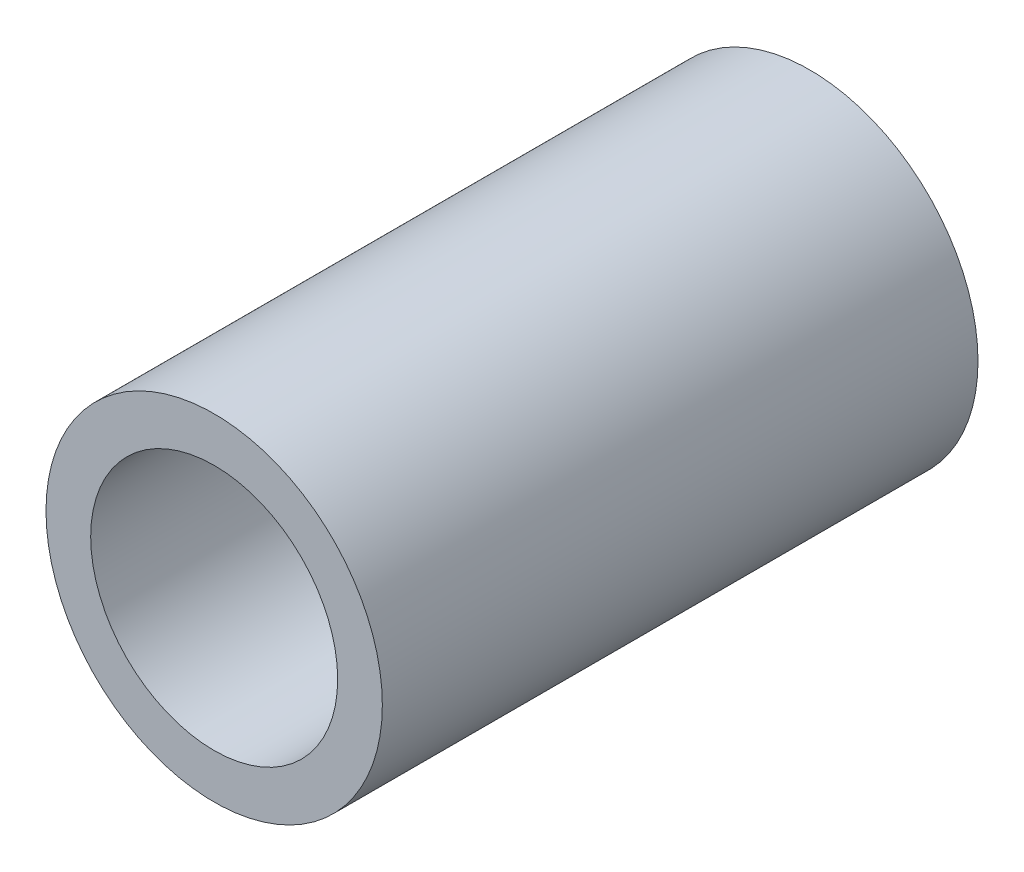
ISO-10303-21;
HEADER;
FILE_DESCRIPTION(('STEP AP214'),'2;1');
FILE_NAME('part.step','',(''),(''),'','','');
FILE_SCHEMA(('AUTOMOTIVE_DESIGN { 1 0 10303 214 1 1 1 1 }'));
ENDSEC;
DATA;
#1=APPLICATION_CONTEXT('core data for automotive mechanical design processes');
#2=APPLICATION_PROTOCOL_DEFINITION('international standard','automotive_design',2000,#1);
#3=PRODUCT_CONTEXT('',#1,'mechanical');
#4=PRODUCT('Part','Part','',(#3));
#5=PRODUCT_RELATED_PRODUCT_CATEGORY('part','',(#4));
#6=PRODUCT_DEFINITION_FORMATION('','',#4);
#7=PRODUCT_DEFINITION_CONTEXT('part definition',#1,'design');
#8=PRODUCT_DEFINITION('design','',#6,#7);
#9=PRODUCT_DEFINITION_SHAPE('','',#8);
#10=(LENGTH_UNIT() NAMED_UNIT(*) SI_UNIT(.MILLI.,.METRE.));
#11=(NAMED_UNIT(*) PLANE_ANGLE_UNIT() SI_UNIT($,.RADIAN.));
#12=(NAMED_UNIT(*) SI_UNIT($,.STERADIAN.) SOLID_ANGLE_UNIT());
#13=UNCERTAINTY_MEASURE_WITH_UNIT(LENGTH_MEASURE(1.E-05),#10,'distance_accuracy_value','');
#14=(GEOMETRIC_REPRESENTATION_CONTEXT(3) GLOBAL_UNCERTAINTY_ASSIGNED_CONTEXT((#13)) GLOBAL_UNIT_ASSIGNED_CONTEXT((#10,
#11,#12)) REPRESENTATION_CONTEXT('',''));
#15=CARTESIAN_POINT('',(0.,0.,0.));
#16=DIRECTION('',(0.,0.,1.));
#17=DIRECTION('',(1.,0.,0.));
#18=AXIS2_PLACEMENT_3D('',#15,#16,#17);
#19=CARTESIAN_POINT('',(0.,0.,19.05));
#20=DIRECTION('',(0.,0.,1.));
#21=DIRECTION('',(1.,0.,0.));
#22=AXIS2_PLACEMENT_3D('',#19,#20,#21);
#23=PLANE('',#22);
#24=CARTESIAN_POINT('',(0.,0.,19.05));
#25=DIRECTION('',(0.,0.,1.));
#26=DIRECTION('',(1.,0.,0.));
#27=AXIS2_PLACEMENT_3D('',#24,#25,#26);
#28=CIRCLE('',#27,10.7569);
#29=CARTESIAN_POINT('',(-10.7569,0.,19.05));
#30=VERTEX_POINT('',#29);
#31=EDGE_CURVE('E10',#30,#30,#28,.T.);
#32=ORIENTED_EDGE('',*,*,#31,.T.);
#33=EDGE_LOOP('',(#32));
#34=FACE_BOUND('',#33,.T.);
#35=CARTESIAN_POINT('',(0.,0.,19.05));
#36=DIRECTION('',(0.,0.,1.));
#37=DIRECTION('',(1.,0.,0.));
#38=AXIS2_PLACEMENT_3D('',#35,#36,#37);
#39=CIRCLE('',#38,7.8994);
#40=CARTESIAN_POINT('',(-7.8994,0.,19.05));
#41=VERTEX_POINT('',#40);
#42=EDGE_CURVE('E43',#41,#41,#39,.T.);
#43=ORIENTED_EDGE('',*,*,#42,.F.);
#44=EDGE_LOOP('',(#43));
#45=FACE_BOUND('',#44,.T.);
#46=ADVANCED_FACE('F32',(#34,#45),#23,.T.);
#47=CARTESIAN_POINT('',(0.,0.,-19.05));
#48=DIRECTION('',(0.,0.,1.));
#49=DIRECTION('',(1.,0.,0.));
#50=AXIS2_PLACEMENT_3D('',#47,#48,#49);
#51=PLANE('',#50);
#52=CARTESIAN_POINT('',(0.,0.,-19.05));
#53=DIRECTION('',(0.,0.,1.));
#54=DIRECTION('',(1.,0.,0.));
#55=AXIS2_PLACEMENT_3D('',#52,#53,#54);
#56=CIRCLE('',#55,10.7569);
#57=CARTESIAN_POINT('',(-10.7569,0.,-19.05));
#58=VERTEX_POINT('',#57);
#59=EDGE_CURVE('E36',#58,#58,#56,.T.);
#60=ORIENTED_EDGE('',*,*,#59,.F.);
#61=EDGE_LOOP('',(#60));
#62=FACE_BOUND('',#61,.T.);
#63=CARTESIAN_POINT('',(0.,0.,-19.05));
#64=DIRECTION('',(0.,0.,1.));
#65=DIRECTION('',(1.,0.,0.));
#66=AXIS2_PLACEMENT_3D('',#63,#64,#65);
#67=CIRCLE('',#66,7.8994);
#68=CARTESIAN_POINT('',(-7.8994,0.,-19.05));
#69=VERTEX_POINT('',#68);
#70=EDGE_CURVE('E45',#69,#69,#67,.T.);
#71=ORIENTED_EDGE('',*,*,#70,.T.);
#72=EDGE_LOOP('',(#71));
#73=FACE_BOUND('',#72,.T.);
#74=ADVANCED_FACE('F55',(#62,#73),#51,.F.);
#75=CARTESIAN_POINT('',(0.,0.,19.05));
#76=DIRECTION('',(0.,0.,-1.));
#77=DIRECTION('',(-1.,0.,0.));
#78=AXIS2_PLACEMENT_3D('',#75,#76,#77);
#79=CYLINDRICAL_SURFACE('',#78,10.7569);
#80=CARTESIAN_POINT('',(-10.7569,0.,19.05));
#81=CARTESIAN_POINT('',(-10.7569,0.,18.653125));
#82=CARTESIAN_POINT('',(-10.7569,0.,18.25625));
#83=CARTESIAN_POINT('',(-10.7569,0.,17.4625));
#84=CARTESIAN_POINT('',(-10.7569,0.,17.065625));
#85=CARTESIAN_POINT('',(-10.7569,0.,16.271875));
#86=CARTESIAN_POINT('',(-10.7569,0.,15.875));
#87=CARTESIAN_POINT('',(-10.7569,0.,15.08125));
#88=CARTESIAN_POINT('',(-10.7569,0.,14.684375));
#89=CARTESIAN_POINT('',(-10.7569,0.,13.890625));
#90=CARTESIAN_POINT('',(-10.7569,0.,13.49375));
#91=CARTESIAN_POINT('',(-10.7569,0.,12.7));
#92=CARTESIAN_POINT('',(-10.7569,0.,12.303125));
#93=CARTESIAN_POINT('',(-10.7569,0.,11.509375));
#94=CARTESIAN_POINT('',(-10.7569,0.,11.1125));
#95=CARTESIAN_POINT('',(-10.7569,0.,10.31875));
#96=CARTESIAN_POINT('',(-10.7569,0.,9.921875));
#97=CARTESIAN_POINT('',(-10.7569,0.,9.128125));
#98=CARTESIAN_POINT('',(-10.7569,0.,8.73125));
#99=CARTESIAN_POINT('',(-10.7569,0.,7.9375));
#100=CARTESIAN_POINT('',(-10.7569,0.,7.540625));
#101=CARTESIAN_POINT('',(-10.7569,0.,6.746875));
#102=CARTESIAN_POINT('',(-10.7569,0.,6.35));
#103=CARTESIAN_POINT('',(-10.7569,0.,5.55625));
#104=CARTESIAN_POINT('',(-10.7569,0.,5.159375));
#105=CARTESIAN_POINT('',(-10.7569,0.,4.365625));
#106=CARTESIAN_POINT('',(-10.7569,0.,3.96875));
#107=CARTESIAN_POINT('',(-10.7569,0.,3.175));
#108=CARTESIAN_POINT('',(-10.7569,0.,2.778125));
#109=CARTESIAN_POINT('',(-10.7569,0.,1.984375));
#110=CARTESIAN_POINT('',(-10.7569,0.,1.5875));
#111=CARTESIAN_POINT('',(-10.7569,0.,0.793749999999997));
#112=CARTESIAN_POINT('',(-10.7569,0.,0.396874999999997));
#113=CARTESIAN_POINT('',(-10.7569,0.,-0.396875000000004));
#114=CARTESIAN_POINT('',(-10.7569,0.,-0.793750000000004));
#115=CARTESIAN_POINT('',(-10.7569,0.,-1.5875));
#116=CARTESIAN_POINT('',(-10.7569,0.,-1.984375));
#117=CARTESIAN_POINT('',(-10.7569,0.,-2.77812500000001));
#118=CARTESIAN_POINT('',(-10.7569,0.,-3.17500000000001));
#119=CARTESIAN_POINT('',(-10.7569,0.,-3.96875000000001));
#120=CARTESIAN_POINT('',(-10.7569,0.,-4.36562500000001));
#121=CARTESIAN_POINT('',(-10.7569,0.,-5.15937500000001));
#122=CARTESIAN_POINT('',(-10.7569,0.,-5.55625));
#123=CARTESIAN_POINT('',(-10.7569,0.,-6.35));
#124=CARTESIAN_POINT('',(-10.7569,0.,-6.746875));
#125=CARTESIAN_POINT('',(-10.7569,0.,-7.540625));
#126=CARTESIAN_POINT('',(-10.7569,0.,-7.93750000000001));
#127=CARTESIAN_POINT('',(-10.7569,0.,-8.73125));
#128=CARTESIAN_POINT('',(-10.7569,0.,-9.12812500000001));
#129=CARTESIAN_POINT('',(-10.7569,0.,-9.92187500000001));
#130=CARTESIAN_POINT('',(-10.7569,0.,-10.31875));
#131=CARTESIAN_POINT('',(-10.7569,0.,-11.1125));
#132=CARTESIAN_POINT('',(-10.7569,0.,-11.509375));
#133=CARTESIAN_POINT('',(-10.7569,0.,-12.303125));
#134=CARTESIAN_POINT('',(-10.7569,0.,-12.7));
#135=CARTESIAN_POINT('',(-10.7569,0.,-13.49375));
#136=CARTESIAN_POINT('',(-10.7569,0.,-13.890625));
#137=CARTESIAN_POINT('',(-10.7569,0.,-14.684375));
#138=CARTESIAN_POINT('',(-10.7569,0.,-15.08125));
#139=CARTESIAN_POINT('',(-10.7569,0.,-15.875));
#140=CARTESIAN_POINT('',(-10.7569,0.,-16.271875));
#141=CARTESIAN_POINT('',(-10.7569,0.,-17.065625));
#142=CARTESIAN_POINT('',(-10.7569,0.,-17.4625));
#143=CARTESIAN_POINT('',(-10.7569,0.,-18.25625));
#144=CARTESIAN_POINT('',(-10.7569,0.,-18.653125));
#145=CARTESIAN_POINT('',(-10.7569,0.,-19.05));
#146=B_SPLINE_CURVE_WITH_KNOTS('',3,(#80,#81,#82,#83,#84,#85,#86,#87,#88,#89,#90,#91,#92,#93,
#94,#95,#96,#97,#98,#99,#100,#101,#102,#103,#104,#105,#106,#107,#108,#109,#110,#111,#112,#113,
#114,#115,#116,#117,#118,#119,#120,#121,#122,#123,#124,#125,#126,#127,#128,#129,#130,#131,#132,
#133,#134,#135,#136,#137,#138,#139,#140,#141,#142,#143,#144,#145),.UNSPECIFIED.,.F.,.F.,(4,2,2,
2,2,2,2,2,2,2,2,2,2,2,2,2,2,2,2,2,2,2,2,2,2,2,2,2,2,2,2,2,4),(0.,1.190625,2.38125,3.571875,
4.7625,5.953125,7.14375,8.334375,9.525,10.715625,11.90625,13.096875,14.2875,15.478125,16.66875,
17.859375,19.05,20.240625,21.43125,22.621875,23.8125,25.003125,26.19375,27.384375,28.575,
29.765625,30.95625,32.146875,33.3375,34.528125,35.71875,36.909375,38.1),.UNSPECIFIED.);
#147=EDGE_CURVE('BSEAM34',#30,#58,#146,.T.);
#148=ORIENTED_EDGE('',*,*,#31,.F.);
#149=ORIENTED_EDGE('',*,*,#59,.T.);
#150=ORIENTED_EDGE('',*,*,#147,.T.);
#151=ORIENTED_EDGE('',*,*,#147,.F.);
#152=EDGE_LOOP('',(#148,#150,#149,#151));
#153=FACE_BOUND('',#152,.T.);
#154=ADVANCED_FACE('F34',(#153),#79,.T.);
#155=CARTESIAN_POINT('',(0.,0.,19.05));
#156=DIRECTION('',(0.,0.,-1.));
#157=DIRECTION('',(-1.,0.,0.));
#158=AXIS2_PLACEMENT_3D('',#155,#156,#157);
#159=CYLINDRICAL_SURFACE('',#158,7.8994);
#160=CARTESIAN_POINT('',(-7.8994,0.,19.05));
#161=CARTESIAN_POINT('',(-7.8994,0.,18.653125));
#162=CARTESIAN_POINT('',(-7.8994,0.,18.25625));
#163=CARTESIAN_POINT('',(-7.8994,0.,17.4625));
#164=CARTESIAN_POINT('',(-7.8994,0.,17.065625));
#165=CARTESIAN_POINT('',(-7.8994,0.,16.271875));
#166=CARTESIAN_POINT('',(-7.8994,0.,15.875));
#167=CARTESIAN_POINT('',(-7.8994,0.,15.08125));
#168=CARTESIAN_POINT('',(-7.8994,0.,14.684375));
#169=CARTESIAN_POINT('',(-7.8994,0.,13.890625));
#170=CARTESIAN_POINT('',(-7.8994,0.,13.49375));
#171=CARTESIAN_POINT('',(-7.8994,0.,12.7));
#172=CARTESIAN_POINT('',(-7.8994,0.,12.303125));
#173=CARTESIAN_POINT('',(-7.8994,0.,11.509375));
#174=CARTESIAN_POINT('',(-7.8994,0.,11.1125));
#175=CARTESIAN_POINT('',(-7.8994,0.,10.31875));
#176=CARTESIAN_POINT('',(-7.8994,0.,9.921875));
#177=CARTESIAN_POINT('',(-7.8994,0.,9.128125));
#178=CARTESIAN_POINT('',(-7.8994,0.,8.73125));
#179=CARTESIAN_POINT('',(-7.8994,0.,7.9375));
#180=CARTESIAN_POINT('',(-7.8994,0.,7.540625));
#181=CARTESIAN_POINT('',(-7.8994,0.,6.746875));
#182=CARTESIAN_POINT('',(-7.8994,0.,6.35));
#183=CARTESIAN_POINT('',(-7.8994,0.,5.55625));
#184=CARTESIAN_POINT('',(-7.8994,0.,5.159375));
#185=CARTESIAN_POINT('',(-7.8994,0.,4.365625));
#186=CARTESIAN_POINT('',(-7.8994,0.,3.96875));
#187=CARTESIAN_POINT('',(-7.8994,0.,3.175));
#188=CARTESIAN_POINT('',(-7.8994,0.,2.778125));
#189=CARTESIAN_POINT('',(-7.8994,0.,1.984375));
#190=CARTESIAN_POINT('',(-7.8994,0.,1.5875));
#191=CARTESIAN_POINT('',(-7.8994,0.,0.79375));
#192=CARTESIAN_POINT('',(-7.8994,0.,0.396875));
#193=CARTESIAN_POINT('',(-7.8994,0.,-0.396875));
#194=CARTESIAN_POINT('',(-7.8994,0.,-0.79375));
#195=CARTESIAN_POINT('',(-7.8994,0.,-1.5875));
#196=CARTESIAN_POINT('',(-7.8994,0.,-1.984375));
#197=CARTESIAN_POINT('',(-7.8994,0.,-2.778125));
#198=CARTESIAN_POINT('',(-7.8994,0.,-3.175));
#199=CARTESIAN_POINT('',(-7.8994,0.,-3.96875));
#200=CARTESIAN_POINT('',(-7.8994,0.,-4.365625));
#201=CARTESIAN_POINT('',(-7.8994,0.,-5.159375));
#202=CARTESIAN_POINT('',(-7.8994,0.,-5.55625));
#203=CARTESIAN_POINT('',(-7.8994,0.,-6.35));
#204=CARTESIAN_POINT('',(-7.8994,0.,-6.746875));
#205=CARTESIAN_POINT('',(-7.8994,0.,-7.540625));
#206=CARTESIAN_POINT('',(-7.8994,0.,-7.9375));
#207=CARTESIAN_POINT('',(-7.8994,0.,-8.73125));
#208=CARTESIAN_POINT('',(-7.8994,0.,-9.128125));
#209=CARTESIAN_POINT('',(-7.8994,0.,-9.921875));
#210=CARTESIAN_POINT('',(-7.8994,0.,-10.31875));
#211=CARTESIAN_POINT('',(-7.8994,0.,-11.1125));
#212=CARTESIAN_POINT('',(-7.8994,0.,-11.509375));
#213=CARTESIAN_POINT('',(-7.8994,0.,-12.303125));
#214=CARTESIAN_POINT('',(-7.8994,0.,-12.7));
#215=CARTESIAN_POINT('',(-7.8994,0.,-13.49375));
#216=CARTESIAN_POINT('',(-7.8994,0.,-13.890625));
#217=CARTESIAN_POINT('',(-7.8994,0.,-14.684375));
#218=CARTESIAN_POINT('',(-7.8994,0.,-15.08125));
#219=CARTESIAN_POINT('',(-7.8994,0.,-15.875));
#220=CARTESIAN_POINT('',(-7.8994,0.,-16.271875));
#221=CARTESIAN_POINT('',(-7.8994,0.,-17.065625));
#222=CARTESIAN_POINT('',(-7.8994,0.,-17.4625));
#223=CARTESIAN_POINT('',(-7.8994,0.,-18.25625));
#224=CARTESIAN_POINT('',(-7.8994,0.,-18.653125));
#225=CARTESIAN_POINT('',(-7.8994,0.,-19.05));
#226=B_SPLINE_CURVE_WITH_KNOTS('',3,(#160,#161,#162,#163,#164,#165,#166,#167,#168,#169,#170,
#171,#172,#173,#174,#175,#176,#177,#178,#179,#180,#181,#182,#183,#184,#185,#186,#187,#188,#189,
#190,#191,#192,#193,#194,#195,#196,#197,#198,#199,#200,#201,#202,#203,#204,#205,#206,#207,#208,
#209,#210,#211,#212,#213,#214,#215,#216,#217,#218,#219,#220,#221,#222,#223,#224,#225),
.UNSPECIFIED.,.F.,.F.,(4,2,2,2,2,2,2,2,2,2,2,2,2,2,2,2,2,2,2,2,2,2,2,2,2,2,2,2,2,2,2,2,4),(0.,
1.190625,2.38125,3.571875,4.7625,5.953125,7.14375,8.334375,9.525,10.715625,11.90625,13.096875,
14.2875,15.478125,16.66875,17.859375,19.05,20.240625,21.43125,22.621875,23.8125,25.003125,
26.19375,27.384375,28.575,29.765625,30.95625,32.146875,33.3375,34.528125,35.71875,36.909375,
38.1),.UNSPECIFIED.);
#227=EDGE_CURVE('BSEAM51',#41,#69,#226,.T.);
#228=ORIENTED_EDGE('',*,*,#42,.T.);
#229=ORIENTED_EDGE('',*,*,#70,.F.);
#230=ORIENTED_EDGE('',*,*,#227,.T.);
#231=ORIENTED_EDGE('',*,*,#227,.F.);
#232=EDGE_LOOP('',(#228,#230,#229,#231));
#233=FACE_BOUND('',#232,.T.);
#234=ADVANCED_FACE('F51',(#233),#159,.F.);
#235=CLOSED_SHELL('',(#46,#74,#154,#234));
#236=MANIFOLD_SOLID_BREP('B2',#235);
#237=ADVANCED_BREP_SHAPE_REPRESENTATION('',(#18,#236),#14);
#238=SHAPE_DEFINITION_REPRESENTATION(#9,#237);
ENDSEC;
END-ISO-10303-21;
